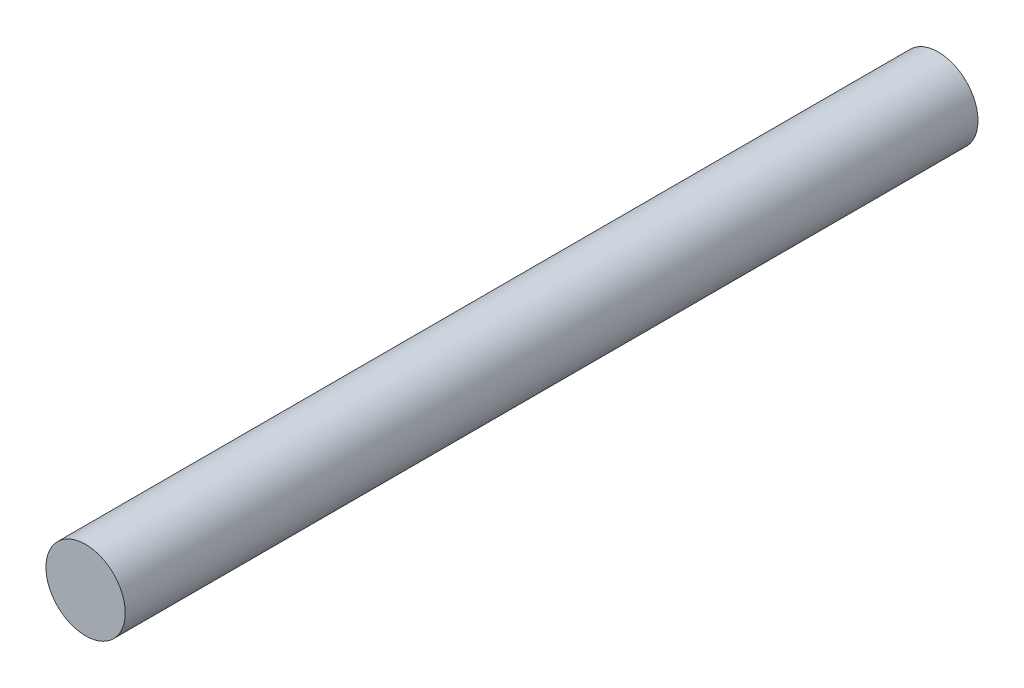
ISO-10303-21;
HEADER;
FILE_DESCRIPTION(('STEP AP214'),'2;1');
FILE_NAME('part.step','',(''),(''),'','','');
FILE_SCHEMA(('AUTOMOTIVE_DESIGN { 1 0 10303 214 1 1 1 1 }'));
ENDSEC;
DATA;
#1=APPLICATION_CONTEXT('core data for automotive mechanical design processes');
#2=APPLICATION_PROTOCOL_DEFINITION('international standard','automotive_design',2000,#1);
#3=PRODUCT_CONTEXT('',#1,'mechanical');
#4=PRODUCT('Part','Part','',(#3));
#5=PRODUCT_RELATED_PRODUCT_CATEGORY('part','',(#4));
#6=PRODUCT_DEFINITION_FORMATION('','',#4);
#7=PRODUCT_DEFINITION_CONTEXT('part definition',#1,'design');
#8=PRODUCT_DEFINITION('design','',#6,#7);
#9=PRODUCT_DEFINITION_SHAPE('','',#8);
#10=(LENGTH_UNIT() NAMED_UNIT(*) SI_UNIT(.MILLI.,.METRE.));
#11=(NAMED_UNIT(*) PLANE_ANGLE_UNIT() SI_UNIT($,.RADIAN.));
#12=(NAMED_UNIT(*) SI_UNIT($,.STERADIAN.) SOLID_ANGLE_UNIT());
#13=UNCERTAINTY_MEASURE_WITH_UNIT(LENGTH_MEASURE(1.E-05),#10,'distance_accuracy_value','');
#14=(GEOMETRIC_REPRESENTATION_CONTEXT(3) GLOBAL_UNCERTAINTY_ASSIGNED_CONTEXT((#13)) GLOBAL_UNIT_ASSIGNED_CONTEXT((#10,
#11,#12)) REPRESENTATION_CONTEXT('',''));
#15=CARTESIAN_POINT('',(0.,0.,0.));
#16=DIRECTION('',(0.,0.,1.));
#17=DIRECTION('',(1.,0.,0.));
#18=AXIS2_PLACEMENT_3D('',#15,#16,#17);
#19=CARTESIAN_POINT('',(0.,0.,21.5));
#20=DIRECTION('',(0.,0.,-1.));
#21=DIRECTION('',(-1.,0.,0.));
#22=AXIS2_PLACEMENT_3D('',#19,#20,#21);
#23=CYLINDRICAL_SURFACE('',#22,2.);
#24=CARTESIAN_POINT('',(0.,0.,-21.5));
#25=DIRECTION('',(0.,0.,1.));
#26=DIRECTION('',(1.,0.,0.));
#27=AXIS2_PLACEMENT_3D('',#24,#25,#26);
#28=CIRCLE('',#27,2.);
#29=CARTESIAN_POINT('',(2.,0.,-21.5));
#30=VERTEX_POINT('',#29);
#31=EDGE_CURVE('E147',#30,#30,#28,.T.);
#32=ORIENTED_EDGE('',*,*,#31,.T.);
#33=EDGE_LOOP('',(#32));
#34=FACE_BOUND('',#33,.T.);
#35=CARTESIAN_POINT('',(0.,0.,21.5));
#36=DIRECTION('',(0.,0.,1.));
#37=DIRECTION('',(1.,0.,0.));
#38=AXIS2_PLACEMENT_3D('',#35,#36,#37);
#39=CIRCLE('',#38,2.);
#40=CARTESIAN_POINT('',(2.,0.,21.5));
#41=VERTEX_POINT('',#40);
#42=EDGE_CURVE('E152',#41,#41,#39,.T.);
#43=ORIENTED_EDGE('',*,*,#42,.F.);
#44=EDGE_LOOP('',(#43));
#45=FACE_BOUND('',#44,.T.);
#46=DIRECTION('',(0.,0.,-1.));
#47=VECTOR('',#46,1.);
#48=CARTESIAN_POINT('',(-1.83303027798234,0.8,21.5));
#49=LINE('',#48,#47);
#50=CARTESIAN_POINT('',(-1.83303027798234,0.8,15.5));
#51=VERTEX_POINT('',#50);
#52=CARTESIAN_POINT('',(-1.83303027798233,0.8,19.5));
#53=VERTEX_POINT('',#52);
#54=EDGE_CURVE('E168',#51,#53,#49,.F.);
#55=ORIENTED_EDGE('',*,*,#54,.T.);
#56=CARTESIAN_POINT('',(-1.83303027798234,0.8,19.5));
#57=CARTESIAN_POINT('',(-1.83302744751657,0.800000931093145,19.5215283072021));
#58=CARTESIAN_POINT('',(-1.83341001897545,0.799130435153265,19.5430452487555));
#59=CARTESIAN_POINT('',(-1.83491770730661,0.79566475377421,19.5859055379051));
#60=CARTESIAN_POINT('',(-1.83604254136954,0.793070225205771,19.6072489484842));
#61=CARTESIAN_POINT('',(-1.84047431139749,0.782759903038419,19.6706140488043));
#62=CARTESIAN_POINT('',(-1.84483906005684,0.772516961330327,19.7121798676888));
#63=CARTESIAN_POINT('',(-1.85583810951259,0.745701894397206,19.7928067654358));
#64=CARTESIAN_POINT('',(-1.86247005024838,0.729136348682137,19.8318703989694));
#65=CARTESIAN_POINT('',(-1.8772492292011,0.690194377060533,19.9067095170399));
#66=CARTESIAN_POINT('',(-1.88539790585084,0.667812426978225,19.9424818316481));
#67=CARTESIAN_POINT('',(-1.90280407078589,0.616526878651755,20.0117074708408));
#68=CARTESIAN_POINT('',(-1.91209700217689,0.587347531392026,20.0449475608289));
#69=CARTESIAN_POINT('',(-1.93045114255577,0.523878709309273,20.1062154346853));
#70=CARTESIAN_POINT('',(-1.93951230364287,0.4895881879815,20.1342421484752));
#71=CARTESIAN_POINT('',(-1.95681367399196,0.415202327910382,20.1853627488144));
#72=CARTESIAN_POINT('',(-1.96500729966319,0.374931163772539,20.2082179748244));
#73=CARTESIAN_POINT('',(-1.97921577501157,0.290729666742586,20.2467375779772));
#74=CARTESIAN_POINT('',(-1.98523153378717,0.246800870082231,20.2624049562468));
#75=CARTESIAN_POINT('',(-1.99415325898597,0.158786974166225,20.2853364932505));
#76=CARTESIAN_POINT('',(-1.99719569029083,0.114812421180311,20.2929707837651));
#77=CARTESIAN_POINT('',(-2.00032124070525,0.0261073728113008,20.3008113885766));
#78=CARTESIAN_POINT('',(-2.00040540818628,-0.0186228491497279,20.3010203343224));
#79=CARTESIAN_POINT('',(-1.9976878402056,-0.10489335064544,20.2942068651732));
#80=CARTESIAN_POINT('',(-1.99504794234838,-0.146471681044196,20.2875899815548));
#81=CARTESIAN_POINT('',(-1.98739708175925,-0.227869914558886,20.2680026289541));
#82=CARTESIAN_POINT('',(-1.98238598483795,-0.26768971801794,20.255031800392));
#83=CARTESIAN_POINT('',(-1.97038732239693,-0.345159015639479,20.2229454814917));
#84=CARTESIAN_POINT('',(-1.96337109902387,-0.382766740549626,20.2037403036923));
#85=CARTESIAN_POINT('',(-1.94805840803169,-0.454322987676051,20.1598141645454));
#86=CARTESIAN_POINT('',(-1.93976149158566,-0.488270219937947,20.1350912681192));
#87=CARTESIAN_POINT('',(-1.92208713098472,-0.553905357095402,20.0789423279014));
#88=CARTESIAN_POINT('',(-1.91267450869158,-0.585299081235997,20.0471830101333));
#89=CARTESIAN_POINT('',(-1.89424780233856,-0.642439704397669,19.9788079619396));
#90=CARTESIAN_POINT('',(-1.88523390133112,-0.668184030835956,19.9421900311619));
#91=CARTESIAN_POINT('',(-1.86838275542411,-0.713974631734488,19.8638118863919));
#92=CARTESIAN_POINT('',(-1.86058680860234,-0.733835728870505,19.821934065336));
#93=CARTESIAN_POINT('',(-1.84754442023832,-0.766085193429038,19.7350553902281));
#94=CARTESIAN_POINT('',(-1.84229347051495,-0.778486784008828,19.6900602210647));
#95=CARTESIAN_POINT('',(-1.83683321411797,-0.791242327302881,19.6205025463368));
#96=CARTESIAN_POINT('',(-1.83541375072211,-0.794522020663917,19.5965369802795));
#97=CARTESIAN_POINT('',(-1.83351016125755,-0.798901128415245,19.5483859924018));
#98=CARTESIAN_POINT('',(-1.83302545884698,-0.80000188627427,19.5242007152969));
#99=CARTESIAN_POINT('',(-1.83303027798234,-0.8,19.5));
#100=B_SPLINE_CURVE_WITH_KNOTS('',3,(#56,#57,#58,#59,#60,#61,#62,#63,#64,#65,#66,#67,#68,#69,
#70,#71,#72,#73,#74,#75,#76,#77,#78,#79,#80,#81,#82,#83,#84,#85,#86,#87,#88,#89,#90,#91,#92,#93,
#94,#95,#96,#97,#98,#99),.UNSPECIFIED.,.F.,.F.,(4,2,2,2,2,2,2,2,2,2,2,2,2,2,2,2,2,2,2,2,2,4),
(0.,0.0645419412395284,0.129059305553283,0.257474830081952,0.385757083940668,0.514161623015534,
0.649156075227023,0.784178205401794,0.924535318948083,1.06483377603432,1.19833938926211,
1.33179768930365,1.45775954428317,1.58372852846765,1.71159659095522,1.8395095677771,
1.97581138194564,2.11217513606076,2.25246084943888,2.39249714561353,2.46508465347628,
2.53762739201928),.UNSPECIFIED.);
#101=CARTESIAN_POINT('',(-1.83303027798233,-0.8,19.5));
#102=VERTEX_POINT('',#101);
#103=EDGE_CURVE('E189',#53,#102,#100,.T.);
#104=ORIENTED_EDGE('',*,*,#103,.T.);
#105=DIRECTION('',(0.,0.,-1.));
#106=VECTOR('',#105,1.);
#107=CARTESIAN_POINT('',(-1.83303027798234,-0.8,21.5));
#108=LINE('',#107,#106);
#109=CARTESIAN_POINT('',(-1.83303027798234,-0.8,15.5));
#110=VERTEX_POINT('',#109);
#111=EDGE_CURVE('E155',#102,#110,#108,.T.);
#112=ORIENTED_EDGE('',*,*,#111,.T.);
#113=CARTESIAN_POINT('',(-1.83303027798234,-0.8,15.5));
#114=CARTESIAN_POINT('',(-1.83302744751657,-0.800000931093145,15.4784716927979));
#115=CARTESIAN_POINT('',(-1.83341001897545,-0.799130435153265,15.4569547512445));
#116=CARTESIAN_POINT('',(-1.83491770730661,-0.79566475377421,15.4140944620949));
#117=CARTESIAN_POINT('',(-1.83604254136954,-0.793070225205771,15.3927510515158));
#118=CARTESIAN_POINT('',(-1.84047431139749,-0.782759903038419,15.3293859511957));
#119=CARTESIAN_POINT('',(-1.84483906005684,-0.772516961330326,15.2878201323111));
#120=CARTESIAN_POINT('',(-1.85583810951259,-0.745701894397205,15.2071932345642));
#121=CARTESIAN_POINT('',(-1.86247005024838,-0.729136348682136,15.1681296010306));
#122=CARTESIAN_POINT('',(-1.8772492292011,-0.690194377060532,15.0932904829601));
#123=CARTESIAN_POINT('',(-1.88539790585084,-0.667812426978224,15.0575181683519));
#124=CARTESIAN_POINT('',(-1.90280407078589,-0.616526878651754,14.9882925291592));
#125=CARTESIAN_POINT('',(-1.91209700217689,-0.587347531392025,14.9550524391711));
#126=CARTESIAN_POINT('',(-1.93045114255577,-0.523878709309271,14.8937845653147));
#127=CARTESIAN_POINT('',(-1.93951230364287,-0.489588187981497,14.8657578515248));
#128=CARTESIAN_POINT('',(-1.95681367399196,-0.415202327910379,14.8146372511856));
#129=CARTESIAN_POINT('',(-1.96500729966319,-0.374931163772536,14.7917820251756));
#130=CARTESIAN_POINT('',(-1.97921577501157,-0.290729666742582,14.7532624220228));
#131=CARTESIAN_POINT('',(-1.98523153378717,-0.246800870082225,14.7375950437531));
#132=CARTESIAN_POINT('',(-1.99415325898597,-0.15878697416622,14.7146635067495));
#133=CARTESIAN_POINT('',(-1.99719569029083,-0.114812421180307,14.7070292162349));
#134=CARTESIAN_POINT('',(-2.00032124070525,-0.0261073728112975,14.6991886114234));
#135=CARTESIAN_POINT('',(-2.00040540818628,0.0186228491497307,14.6989796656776));
#136=CARTESIAN_POINT('',(-1.9976878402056,0.104893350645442,14.7057931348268));
#137=CARTESIAN_POINT('',(-1.99504794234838,0.146471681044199,14.7124100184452));
#138=CARTESIAN_POINT('',(-1.98739708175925,0.227869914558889,14.7319973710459));
#139=CARTESIAN_POINT('',(-1.98238598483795,0.267689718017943,14.744968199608));
#140=CARTESIAN_POINT('',(-1.97038732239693,0.345159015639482,14.7770545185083));
#141=CARTESIAN_POINT('',(-1.96337109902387,0.382766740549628,14.7962596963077));
#142=CARTESIAN_POINT('',(-1.94805840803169,0.454322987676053,14.8401858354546));
#143=CARTESIAN_POINT('',(-1.93976149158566,0.488270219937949,14.8649087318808));
#144=CARTESIAN_POINT('',(-1.92208713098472,0.553905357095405,14.9210576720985));
#145=CARTESIAN_POINT('',(-1.91267450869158,0.585299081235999,14.9528169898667));
#146=CARTESIAN_POINT('',(-1.89424780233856,0.642439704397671,15.0211920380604));
#147=CARTESIAN_POINT('',(-1.88523390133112,0.668184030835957,15.0578099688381));
#148=CARTESIAN_POINT('',(-1.86838275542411,0.713974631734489,15.1361881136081));
#149=CARTESIAN_POINT('',(-1.86058680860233,0.733835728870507,15.178065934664));
#150=CARTESIAN_POINT('',(-1.84754442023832,0.76608519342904,15.2649446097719));
#151=CARTESIAN_POINT('',(-1.84229347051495,0.778486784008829,15.3099397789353));
#152=CARTESIAN_POINT('',(-1.83683321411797,0.791242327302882,15.3794974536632));
#153=CARTESIAN_POINT('',(-1.83541375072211,0.794522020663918,15.4034630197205));
#154=CARTESIAN_POINT('',(-1.83351016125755,0.798901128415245,15.4516140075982));
#155=CARTESIAN_POINT('',(-1.83302545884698,0.80000188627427,15.4757992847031));
#156=CARTESIAN_POINT('',(-1.83303027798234,0.8,15.5));
#157=B_SPLINE_CURVE_WITH_KNOTS('',3,(#113,#114,#115,#116,#117,#118,#119,#120,#121,#122,#123,
#124,#125,#126,#127,#128,#129,#130,#131,#132,#133,#134,#135,#136,#137,#138,#139,#140,#141,#142,
#143,#144,#145,#146,#147,#148,#149,#150,#151,#152,#153,#154,#155,#156),.UNSPECIFIED.,.F.,.F.,(4,
2,2,2,2,2,2,2,2,2,2,2,2,2,2,2,2,2,2,2,2,4),(0.,0.0645419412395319,0.129059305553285,
0.257474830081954,0.38575708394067,0.514161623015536,0.649156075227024,0.784178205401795,
0.924535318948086,1.06483377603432,1.19833938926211,1.33179768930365,1.45775954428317,
1.58372852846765,1.71159659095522,1.83950956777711,1.97581138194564,2.11217513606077,
2.25246084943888,2.39249714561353,2.46508465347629,2.53762739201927),.UNSPECIFIED.);
#158=EDGE_CURVE('E160',#110,#51,#157,.T.);
#159=ORIENTED_EDGE('',*,*,#158,.T.);
#160=EDGE_LOOP('',(#55,#104,#112,#159));
#161=FACE_BOUND('',#160,.T.);
#162=CARTESIAN_POINT('',(-1.83303027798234,0.8,-19.5));
#163=CARTESIAN_POINT('',(-1.83302744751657,0.800000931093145,-19.5215283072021));
#164=CARTESIAN_POINT('',(-1.83341001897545,0.799130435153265,-19.5430452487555));
#165=CARTESIAN_POINT('',(-1.83491770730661,0.79566475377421,-19.5859055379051));
#166=CARTESIAN_POINT('',(-1.83604254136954,0.793070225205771,-19.6072489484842));
#167=CARTESIAN_POINT('',(-1.84047431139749,0.782759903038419,-19.6706140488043));
#168=CARTESIAN_POINT('',(-1.84483906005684,0.772516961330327,-19.7121798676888));
#169=CARTESIAN_POINT('',(-1.85583810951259,0.745701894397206,-19.7928067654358));
#170=CARTESIAN_POINT('',(-1.86247005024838,0.729136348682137,-19.8318703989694));
#171=CARTESIAN_POINT('',(-1.8772492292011,0.690194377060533,-19.9067095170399));
#172=CARTESIAN_POINT('',(-1.88539790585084,0.667812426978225,-19.9424818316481));
#173=CARTESIAN_POINT('',(-1.90280407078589,0.616526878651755,-20.0117074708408));
#174=CARTESIAN_POINT('',(-1.91209700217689,0.587347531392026,-20.0449475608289));
#175=CARTESIAN_POINT('',(-1.93045114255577,0.523878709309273,-20.1062154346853));
#176=CARTESIAN_POINT('',(-1.93951230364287,0.4895881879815,-20.1342421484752));
#177=CARTESIAN_POINT('',(-1.95681367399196,0.415202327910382,-20.1853627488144));
#178=CARTESIAN_POINT('',(-1.96500729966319,0.374931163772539,-20.2082179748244));
#179=CARTESIAN_POINT('',(-1.97921577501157,0.290729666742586,-20.2467375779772));
#180=CARTESIAN_POINT('',(-1.98523153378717,0.246800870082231,-20.2624049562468));
#181=CARTESIAN_POINT('',(-1.99415325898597,0.158786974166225,-20.2853364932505));
#182=CARTESIAN_POINT('',(-1.99719569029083,0.114812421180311,-20.2929707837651));
#183=CARTESIAN_POINT('',(-2.00032124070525,0.0261073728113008,-20.3008113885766));
#184=CARTESIAN_POINT('',(-2.00040540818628,-0.0186228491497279,-20.3010203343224));
#185=CARTESIAN_POINT('',(-1.9976878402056,-0.10489335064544,-20.2942068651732));
#186=CARTESIAN_POINT('',(-1.99504794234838,-0.146471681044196,-20.2875899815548));
#187=CARTESIAN_POINT('',(-1.98739708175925,-0.227869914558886,-20.2680026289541));
#188=CARTESIAN_POINT('',(-1.98238598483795,-0.26768971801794,-20.255031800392));
#189=CARTESIAN_POINT('',(-1.97038732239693,-0.345159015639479,-20.2229454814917));
#190=CARTESIAN_POINT('',(-1.96337109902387,-0.382766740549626,-20.2037403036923));
#191=CARTESIAN_POINT('',(-1.94805840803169,-0.454322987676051,-20.1598141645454));
#192=CARTESIAN_POINT('',(-1.93976149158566,-0.488270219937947,-20.1350912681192));
#193=CARTESIAN_POINT('',(-1.92208713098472,-0.553905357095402,-20.0789423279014));
#194=CARTESIAN_POINT('',(-1.91267450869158,-0.585299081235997,-20.0471830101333));
#195=CARTESIAN_POINT('',(-1.89424780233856,-0.642439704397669,-19.9788079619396));
#196=CARTESIAN_POINT('',(-1.88523390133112,-0.668184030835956,-19.9421900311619));
#197=CARTESIAN_POINT('',(-1.86838275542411,-0.713974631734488,-19.8638118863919));
#198=CARTESIAN_POINT('',(-1.86058680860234,-0.733835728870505,-19.821934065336));
#199=CARTESIAN_POINT('',(-1.84754442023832,-0.766085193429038,-19.7350553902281));
#200=CARTESIAN_POINT('',(-1.84229347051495,-0.778486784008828,-19.6900602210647));
#201=CARTESIAN_POINT('',(-1.83683321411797,-0.791242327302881,-19.6205025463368));
#202=CARTESIAN_POINT('',(-1.83541375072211,-0.794522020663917,-19.5965369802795));
#203=CARTESIAN_POINT('',(-1.83351016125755,-0.798901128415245,-19.5483859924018));
#204=CARTESIAN_POINT('',(-1.83302545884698,-0.80000188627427,-19.5242007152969));
#205=CARTESIAN_POINT('',(-1.83303027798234,-0.8,-19.5));
#206=B_SPLINE_CURVE_WITH_KNOTS('',3,(#162,#163,#164,#165,#166,#167,#168,#169,#170,#171,#172,
#173,#174,#175,#176,#177,#178,#179,#180,#181,#182,#183,#184,#185,#186,#187,#188,#189,#190,#191,
#192,#193,#194,#195,#196,#197,#198,#199,#200,#201,#202,#203,#204,#205),.UNSPECIFIED.,.F.,.F.,(4,
2,2,2,2,2,2,2,2,2,2,2,2,2,2,2,2,2,2,2,2,4),(0.,0.0645419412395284,0.129059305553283,
0.257474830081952,0.385757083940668,0.514161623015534,0.649156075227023,0.784178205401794,
0.924535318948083,1.06483377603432,1.19833938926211,1.33179768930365,1.45775954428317,
1.58372852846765,1.71159659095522,1.8395095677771,1.97581138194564,2.11217513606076,
2.25246084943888,2.39249714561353,2.46508465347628,2.53762739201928),.UNSPECIFIED.);
#207=CARTESIAN_POINT('',(-1.83303027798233,0.8,-19.5));
#208=VERTEX_POINT('',#207);
#209=CARTESIAN_POINT('',(-1.83303027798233,-0.8,-19.5));
#210=VERTEX_POINT('',#209);
#211=EDGE_CURVE('E11',#208,#210,#206,.T.);
#212=ORIENTED_EDGE('',*,*,#211,.F.);
#213=DIRECTION('',(0.,0.,-1.));
#214=VECTOR('',#213,1.);
#215=CARTESIAN_POINT('',(-1.83303027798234,0.8,21.5));
#216=LINE('',#215,#214);
#217=CARTESIAN_POINT('',(-1.83303027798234,0.8,-15.5));
#218=VERTEX_POINT('',#217);
#219=EDGE_CURVE('E106',#218,#208,#216,.T.);
#220=ORIENTED_EDGE('',*,*,#219,.F.);
#221=CARTESIAN_POINT('',(-1.83303027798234,-0.8,-15.5));
#222=CARTESIAN_POINT('',(-1.83302744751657,-0.800000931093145,-15.4784716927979));
#223=CARTESIAN_POINT('',(-1.83341001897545,-0.799130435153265,-15.4569547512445));
#224=CARTESIAN_POINT('',(-1.83491770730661,-0.79566475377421,-15.4140944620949));
#225=CARTESIAN_POINT('',(-1.83604254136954,-0.793070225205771,-15.3927510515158));
#226=CARTESIAN_POINT('',(-1.84047431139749,-0.782759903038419,-15.3293859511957));
#227=CARTESIAN_POINT('',(-1.84483906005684,-0.772516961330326,-15.2878201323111));
#228=CARTESIAN_POINT('',(-1.85583810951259,-0.745701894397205,-15.2071932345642));
#229=CARTESIAN_POINT('',(-1.86247005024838,-0.729136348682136,-15.1681296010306));
#230=CARTESIAN_POINT('',(-1.8772492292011,-0.690194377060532,-15.0932904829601));
#231=CARTESIAN_POINT('',(-1.88539790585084,-0.667812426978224,-15.0575181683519));
#232=CARTESIAN_POINT('',(-1.90280407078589,-0.616526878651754,-14.9882925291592));
#233=CARTESIAN_POINT('',(-1.91209700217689,-0.587347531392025,-14.9550524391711));
#234=CARTESIAN_POINT('',(-1.93045114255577,-0.523878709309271,-14.8937845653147));
#235=CARTESIAN_POINT('',(-1.93951230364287,-0.489588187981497,-14.8657578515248));
#236=CARTESIAN_POINT('',(-1.95681367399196,-0.415202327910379,-14.8146372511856));
#237=CARTESIAN_POINT('',(-1.96500729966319,-0.374931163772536,-14.7917820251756));
#238=CARTESIAN_POINT('',(-1.97921577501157,-0.290729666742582,-14.7532624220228));
#239=CARTESIAN_POINT('',(-1.98523153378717,-0.246800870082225,-14.7375950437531));
#240=CARTESIAN_POINT('',(-1.99415325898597,-0.15878697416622,-14.7146635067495));
#241=CARTESIAN_POINT('',(-1.99719569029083,-0.114812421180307,-14.7070292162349));
#242=CARTESIAN_POINT('',(-2.00032124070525,-0.0261073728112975,-14.6991886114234));
#243=CARTESIAN_POINT('',(-2.00040540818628,0.0186228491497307,-14.6989796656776));
#244=CARTESIAN_POINT('',(-1.9976878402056,0.104893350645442,-14.7057931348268));
#245=CARTESIAN_POINT('',(-1.99504794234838,0.146471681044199,-14.7124100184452));
#246=CARTESIAN_POINT('',(-1.98739708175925,0.227869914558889,-14.7319973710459));
#247=CARTESIAN_POINT('',(-1.98238598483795,0.267689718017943,-14.744968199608));
#248=CARTESIAN_POINT('',(-1.97038732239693,0.345159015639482,-14.7770545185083));
#249=CARTESIAN_POINT('',(-1.96337109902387,0.382766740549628,-14.7962596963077));
#250=CARTESIAN_POINT('',(-1.94805840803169,0.454322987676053,-14.8401858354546));
#251=CARTESIAN_POINT('',(-1.93976149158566,0.488270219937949,-14.8649087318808));
#252=CARTESIAN_POINT('',(-1.92208713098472,0.553905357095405,-14.9210576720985));
#253=CARTESIAN_POINT('',(-1.91267450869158,0.585299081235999,-14.9528169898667));
#254=CARTESIAN_POINT('',(-1.89424780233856,0.642439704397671,-15.0211920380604));
#255=CARTESIAN_POINT('',(-1.88523390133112,0.668184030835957,-15.0578099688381));
#256=CARTESIAN_POINT('',(-1.86838275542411,0.713974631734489,-15.1361881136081));
#257=CARTESIAN_POINT('',(-1.86058680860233,0.733835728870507,-15.178065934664));
#258=CARTESIAN_POINT('',(-1.84754442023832,0.76608519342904,-15.2649446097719));
#259=CARTESIAN_POINT('',(-1.84229347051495,0.778486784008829,-15.3099397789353));
#260=CARTESIAN_POINT('',(-1.83683321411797,0.791242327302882,-15.3794974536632));
#261=CARTESIAN_POINT('',(-1.83541375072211,0.794522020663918,-15.4034630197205));
#262=CARTESIAN_POINT('',(-1.83351016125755,0.798901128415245,-15.4516140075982));
#263=CARTESIAN_POINT('',(-1.83302545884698,0.80000188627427,-15.4757992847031));
#264=CARTESIAN_POINT('',(-1.83303027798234,0.8,-15.5));
#265=B_SPLINE_CURVE_WITH_KNOTS('',3,(#221,#222,#223,#224,#225,#226,#227,#228,#229,#230,#231,
#232,#233,#234,#235,#236,#237,#238,#239,#240,#241,#242,#243,#244,#245,#246,#247,#248,#249,#250,
#251,#252,#253,#254,#255,#256,#257,#258,#259,#260,#261,#262,#263,#264),.UNSPECIFIED.,.F.,.F.,(4,
2,2,2,2,2,2,2,2,2,2,2,2,2,2,2,2,2,2,2,2,4),(0.,0.0645419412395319,0.129059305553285,
0.257474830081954,0.38575708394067,0.514161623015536,0.649156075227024,0.784178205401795,
0.924535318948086,1.06483377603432,1.19833938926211,1.33179768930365,1.45775954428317,
1.58372852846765,1.71159659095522,1.83950956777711,1.97581138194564,2.11217513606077,
2.25246084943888,2.39249714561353,2.46508465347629,2.53762739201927),.UNSPECIFIED.);
#266=CARTESIAN_POINT('',(-1.83303027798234,-0.8,-15.5));
#267=VERTEX_POINT('',#266);
#268=EDGE_CURVE('E197',#267,#218,#265,.T.);
#269=ORIENTED_EDGE('',*,*,#268,.F.);
#270=DIRECTION('',(0.,0.,-1.));
#271=VECTOR('',#270,1.);
#272=CARTESIAN_POINT('',(-1.83303027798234,-0.8,21.5));
#273=LINE('',#272,#271);
#274=EDGE_CURVE('E47',#210,#267,#273,.F.);
#275=ORIENTED_EDGE('',*,*,#274,.F.);
#276=EDGE_LOOP('',(#212,#220,#269,#275));
#277=FACE_BOUND('',#276,.T.);
#278=ADVANCED_FACE('F34',(#34,#45,#161,#277),#23,.T.);
#279=CARTESIAN_POINT('',(0.,0.,21.5));
#280=DIRECTION('',(0.,0.,1.));
#281=DIRECTION('',(1.,0.,0.));
#282=AXIS2_PLACEMENT_3D('',#279,#280,#281);
#283=PLANE('',#282);
#284=ORIENTED_EDGE('',*,*,#42,.T.);
#285=EDGE_LOOP('',(#284));
#286=FACE_BOUND('',#285,.T.);
#287=ADVANCED_FACE('F188',(#286),#283,.T.);
#288=CARTESIAN_POINT('',(0.,0.,-21.5));
#289=DIRECTION('',(0.,0.,1.));
#290=DIRECTION('',(1.,0.,0.));
#291=AXIS2_PLACEMENT_3D('',#288,#289,#290);
#292=PLANE('',#291);
#293=ORIENTED_EDGE('',*,*,#31,.F.);
#294=EDGE_LOOP('',(#293));
#295=FACE_BOUND('',#294,.T.);
#296=ADVANCED_FACE('F186',(#295),#292,.F.);
#297=CARTESIAN_POINT('',(-21.,0.,19.5));
#298=DIRECTION('',(1.,0.,0.));
#299=DIRECTION('',(0.,0.,-1.));
#300=AXIS2_PLACEMENT_3D('',#297,#298,#299);
#301=CYLINDRICAL_SURFACE('',#300,0.8);
#302=DIRECTION('',(1.,0.,0.));
#303=VECTOR('',#302,1.);
#304=CARTESIAN_POINT('',(-21.,0.8,19.5));
#305=LINE('',#304,#303);
#306=CARTESIAN_POINT('',(-1.,0.8,19.5));
#307=VERTEX_POINT('',#306);
#308=EDGE_CURVE('E145',#53,#307,#305,.T.);
#309=ORIENTED_EDGE('',*,*,#308,.T.);
#310=CARTESIAN_POINT('',(-1.,0.,19.5));
#311=DIRECTION('',(1.,0.,0.));
#312=DIRECTION('',(0.,0.,-1.));
#313=AXIS2_PLACEMENT_3D('',#310,#311,#312);
#314=CIRCLE('',#313,0.8);
#315=CARTESIAN_POINT('',(-1.,-0.8,19.5));
#316=VERTEX_POINT('',#315);
#317=EDGE_CURVE('E130',#307,#316,#314,.T.);
#318=ORIENTED_EDGE('',*,*,#317,.T.);
#319=DIRECTION('',(1.,0.,0.));
#320=VECTOR('',#319,1.);
#321=CARTESIAN_POINT('',(-21.,-0.8,19.5));
#322=LINE('',#321,#320);
#323=EDGE_CURVE('E144',#102,#316,#322,.T.);
#324=ORIENTED_EDGE('',*,*,#323,.F.);
#325=ORIENTED_EDGE('',*,*,#103,.F.);
#326=EDGE_LOOP('',(#309,#318,#324,#325));
#327=FACE_BOUND('',#326,.T.);
#328=ADVANCED_FACE('F182',(#327),#301,.F.);
#329=CARTESIAN_POINT('',(-21.,0.8,19.5));
#330=DIRECTION('',(0.,1.,0.));
#331=DIRECTION('',(0.,0.,1.));
#332=AXIS2_PLACEMENT_3D('',#329,#330,#331);
#333=PLANE('',#332);
#334=DIRECTION('',(1.,0.,0.));
#335=VECTOR('',#334,1.);
#336=CARTESIAN_POINT('',(-21.,0.8,15.5));
#337=LINE('',#336,#335);
#338=CARTESIAN_POINT('',(-1.,0.8,15.5));
#339=VERTEX_POINT('',#338);
#340=EDGE_CURVE('E148',#51,#339,#337,.T.);
#341=ORIENTED_EDGE('',*,*,#340,.T.);
#342=DIRECTION('',(0.,0.,1.));
#343=VECTOR('',#342,1.);
#344=CARTESIAN_POINT('',(-1.,0.8,19.5));
#345=LINE('',#344,#343);
#346=EDGE_CURVE('E141',#339,#307,#345,.T.);
#347=ORIENTED_EDGE('',*,*,#346,.T.);
#348=ORIENTED_EDGE('',*,*,#308,.F.);
#349=ORIENTED_EDGE('',*,*,#54,.F.);
#350=EDGE_LOOP('',(#341,#347,#348,#349));
#351=FACE_BOUND('',#350,.T.);
#352=ADVANCED_FACE('F176',(#351),#333,.F.);
#353=CARTESIAN_POINT('',(-21.,0.,15.5));
#354=DIRECTION('',(1.,0.,0.));
#355=DIRECTION('',(0.,0.,-1.));
#356=AXIS2_PLACEMENT_3D('',#353,#354,#355);
#357=CYLINDRICAL_SURFACE('',#356,0.8);
#358=DIRECTION('',(1.,0.,0.));
#359=VECTOR('',#358,1.);
#360=CARTESIAN_POINT('',(-21.,-0.8,15.5));
#361=LINE('',#360,#359);
#362=CARTESIAN_POINT('',(-1.,-0.8,15.5));
#363=VERTEX_POINT('',#362);
#364=EDGE_CURVE('E62',#110,#363,#361,.T.);
#365=ORIENTED_EDGE('',*,*,#364,.T.);
#366=CARTESIAN_POINT('',(-1.,0.,15.5));
#367=DIRECTION('',(1.,0.,0.));
#368=DIRECTION('',(0.,0.,-1.));
#369=AXIS2_PLACEMENT_3D('',#366,#367,#368);
#370=CIRCLE('',#369,0.8);
#371=EDGE_CURVE('E138',#363,#339,#370,.T.);
#372=ORIENTED_EDGE('',*,*,#371,.T.);
#373=ORIENTED_EDGE('',*,*,#340,.F.);
#374=ORIENTED_EDGE('',*,*,#158,.F.);
#375=EDGE_LOOP('',(#365,#372,#373,#374));
#376=FACE_BOUND('',#375,.T.);
#377=ADVANCED_FACE('F170',(#376),#357,.F.);
#378=CARTESIAN_POINT('',(-21.,-0.8,19.5));
#379=DIRECTION('',(0.,-1.,0.));
#380=DIRECTION('',(0.,0.,-1.));
#381=AXIS2_PLACEMENT_3D('',#378,#379,#380);
#382=PLANE('',#381);
#383=ORIENTED_EDGE('',*,*,#323,.T.);
#384=DIRECTION('',(0.,0.,-1.));
#385=VECTOR('',#384,1.);
#386=CARTESIAN_POINT('',(-1.,-0.8,19.5));
#387=LINE('',#386,#385);
#388=EDGE_CURVE('E136',#316,#363,#387,.T.);
#389=ORIENTED_EDGE('',*,*,#388,.T.);
#390=ORIENTED_EDGE('',*,*,#364,.F.);
#391=ORIENTED_EDGE('',*,*,#111,.F.);
#392=EDGE_LOOP('',(#383,#389,#390,#391));
#393=FACE_BOUND('',#392,.T.);
#394=ADVANCED_FACE('F175',(#393),#382,.F.);
#395=CARTESIAN_POINT('',(-1.,0.,19.5));
#396=DIRECTION('',(1.,0.,0.));
#397=DIRECTION('',(0.,0.,-1.));
#398=AXIS2_PLACEMENT_3D('',#395,#396,#397);
#399=PLANE('',#398);
#400=ORIENTED_EDGE('',*,*,#317,.F.);
#401=ORIENTED_EDGE('',*,*,#346,.F.);
#402=ORIENTED_EDGE('',*,*,#371,.F.);
#403=ORIENTED_EDGE('',*,*,#388,.F.);
#404=EDGE_LOOP('',(#400,#401,#402,#403));
#405=FACE_BOUND('',#404,.T.);
#406=ADVANCED_FACE('F181',(#405),#399,.F.);
#407=CARTESIAN_POINT('',(-21.,0.,-19.5));
#408=DIRECTION('',(1.,0.,0.));
#409=DIRECTION('',(0.,0.,-1.));
#410=AXIS2_PLACEMENT_3D('',#407,#408,#409);
#411=CYLINDRICAL_SURFACE('',#410,0.8);
#412=ORIENTED_EDGE('',*,*,#211,.T.);
#413=DIRECTION('',(1.,0.,0.));
#414=VECTOR('',#413,1.);
#415=CARTESIAN_POINT('',(-21.,-0.8,-19.5));
#416=LINE('',#415,#414);
#417=CARTESIAN_POINT('',(-1.,-0.8,-19.5));
#418=VERTEX_POINT('',#417);
#419=EDGE_CURVE('E123',#210,#418,#416,.T.);
#420=ORIENTED_EDGE('',*,*,#419,.T.);
#421=CARTESIAN_POINT('',(-1.,0.,-19.5));
#422=DIRECTION('',(-1.,0.,0.));
#423=DIRECTION('',(0.,0.,1.));
#424=AXIS2_PLACEMENT_3D('',#421,#422,#423);
#425=CIRCLE('',#424,0.8);
#426=CARTESIAN_POINT('',(-1.,0.8,-19.5));
#427=VERTEX_POINT('',#426);
#428=EDGE_CURVE('E117',#427,#418,#425,.T.);
#429=ORIENTED_EDGE('',*,*,#428,.F.);
#430=DIRECTION('',(1.,0.,0.));
#431=VECTOR('',#430,1.);
#432=CARTESIAN_POINT('',(-21.,0.8,-19.5));
#433=LINE('',#432,#431);
#434=EDGE_CURVE('E101',#208,#427,#433,.T.);
#435=ORIENTED_EDGE('',*,*,#434,.F.);
#436=EDGE_LOOP('',(#412,#420,#429,#435));
#437=FACE_BOUND('',#436,.T.);
#438=ADVANCED_FACE('F121',(#437),#411,.F.);
#439=CARTESIAN_POINT('',(-21.,-0.8,-19.5));
#440=DIRECTION('',(0.,1.,0.));
#441=DIRECTION('',(0.,0.,1.));
#442=AXIS2_PLACEMENT_3D('',#439,#440,#441);
#443=PLANE('',#442);
#444=ORIENTED_EDGE('',*,*,#274,.T.);
#445=DIRECTION('',(1.,0.,0.));
#446=VECTOR('',#445,1.);
#447=CARTESIAN_POINT('',(-21.,-0.8,-15.5));
#448=LINE('',#447,#446);
#449=CARTESIAN_POINT('',(-1.,-0.8,-15.5));
#450=VERTEX_POINT('',#449);
#451=EDGE_CURVE('E131',#267,#450,#448,.T.);
#452=ORIENTED_EDGE('',*,*,#451,.T.);
#453=DIRECTION('',(0.,0.,1.));
#454=VECTOR('',#453,1.);
#455=CARTESIAN_POINT('',(-1.,-0.8,-19.5));
#456=LINE('',#455,#454);
#457=EDGE_CURVE('E110',#418,#450,#456,.T.);
#458=ORIENTED_EDGE('',*,*,#457,.F.);
#459=ORIENTED_EDGE('',*,*,#419,.F.);
#460=EDGE_LOOP('',(#444,#452,#458,#459));
#461=FACE_BOUND('',#460,.T.);
#462=ADVANCED_FACE('F208',(#461),#443,.T.);
#463=CARTESIAN_POINT('',(-21.,0.,-15.5));
#464=DIRECTION('',(1.,0.,0.));
#465=DIRECTION('',(0.,0.,-1.));
#466=AXIS2_PLACEMENT_3D('',#463,#464,#465);
#467=CYLINDRICAL_SURFACE('',#466,0.8);
#468=ORIENTED_EDGE('',*,*,#268,.T.);
#469=DIRECTION('',(1.,0.,0.));
#470=VECTOR('',#469,1.);
#471=CARTESIAN_POINT('',(-21.,0.8,-15.5));
#472=LINE('',#471,#470);
#473=CARTESIAN_POINT('',(-1.,0.8,-15.5));
#474=VERTEX_POINT('',#473);
#475=EDGE_CURVE('E54',#218,#474,#472,.T.);
#476=ORIENTED_EDGE('',*,*,#475,.T.);
#477=CARTESIAN_POINT('',(-1.,0.,-15.5));
#478=DIRECTION('',(-1.,0.,0.));
#479=DIRECTION('',(0.,0.,1.));
#480=AXIS2_PLACEMENT_3D('',#477,#478,#479);
#481=CIRCLE('',#480,0.8);
#482=EDGE_CURVE('E119',#450,#474,#481,.T.);
#483=ORIENTED_EDGE('',*,*,#482,.F.);
#484=ORIENTED_EDGE('',*,*,#451,.F.);
#485=EDGE_LOOP('',(#468,#476,#483,#484));
#486=FACE_BOUND('',#485,.T.);
#487=ADVANCED_FACE('F203',(#486),#467,.F.);
#488=CARTESIAN_POINT('',(-21.,0.8,-19.5));
#489=DIRECTION('',(0.,-1.,0.));
#490=DIRECTION('',(0.,0.,-1.));
#491=AXIS2_PLACEMENT_3D('',#488,#489,#490);
#492=PLANE('',#491);
#493=ORIENTED_EDGE('',*,*,#219,.T.);
#494=ORIENTED_EDGE('',*,*,#434,.T.);
#495=DIRECTION('',(0.,0.,-1.));
#496=VECTOR('',#495,1.);
#497=CARTESIAN_POINT('',(-1.,0.8,-19.5));
#498=LINE('',#497,#496);
#499=EDGE_CURVE('E104',#474,#427,#498,.T.);
#500=ORIENTED_EDGE('',*,*,#499,.F.);
#501=ORIENTED_EDGE('',*,*,#475,.F.);
#502=EDGE_LOOP('',(#493,#494,#500,#501));
#503=FACE_BOUND('',#502,.T.);
#504=ADVANCED_FACE('F103',(#503),#492,.T.);
#505=CARTESIAN_POINT('',(-1.,0.,-19.5));
#506=DIRECTION('',(1.,0.,0.));
#507=DIRECTION('',(0.,0.,1.));
#508=AXIS2_PLACEMENT_3D('',#505,#506,#507);
#509=PLANE('',#508);
#510=ORIENTED_EDGE('',*,*,#428,.T.);
#511=ORIENTED_EDGE('',*,*,#457,.T.);
#512=ORIENTED_EDGE('',*,*,#482,.T.);
#513=ORIENTED_EDGE('',*,*,#499,.T.);
#514=EDGE_LOOP('',(#510,#511,#512,#513));
#515=FACE_BOUND('',#514,.T.);
#516=ADVANCED_FACE('F115',(#515),#509,.F.);
#517=CLOSED_SHELL('',(#278,#287,#296,#328,#352,#377,#394,#406,#438,#462,#487,#504,#516));
#518=MANIFOLD_SOLID_BREP('B2',#517);
#519=ADVANCED_BREP_SHAPE_REPRESENTATION('',(#18,#518),#14);
#520=SHAPE_DEFINITION_REPRESENTATION(#9,#519);
ENDSEC;
END-ISO-10303-21;
